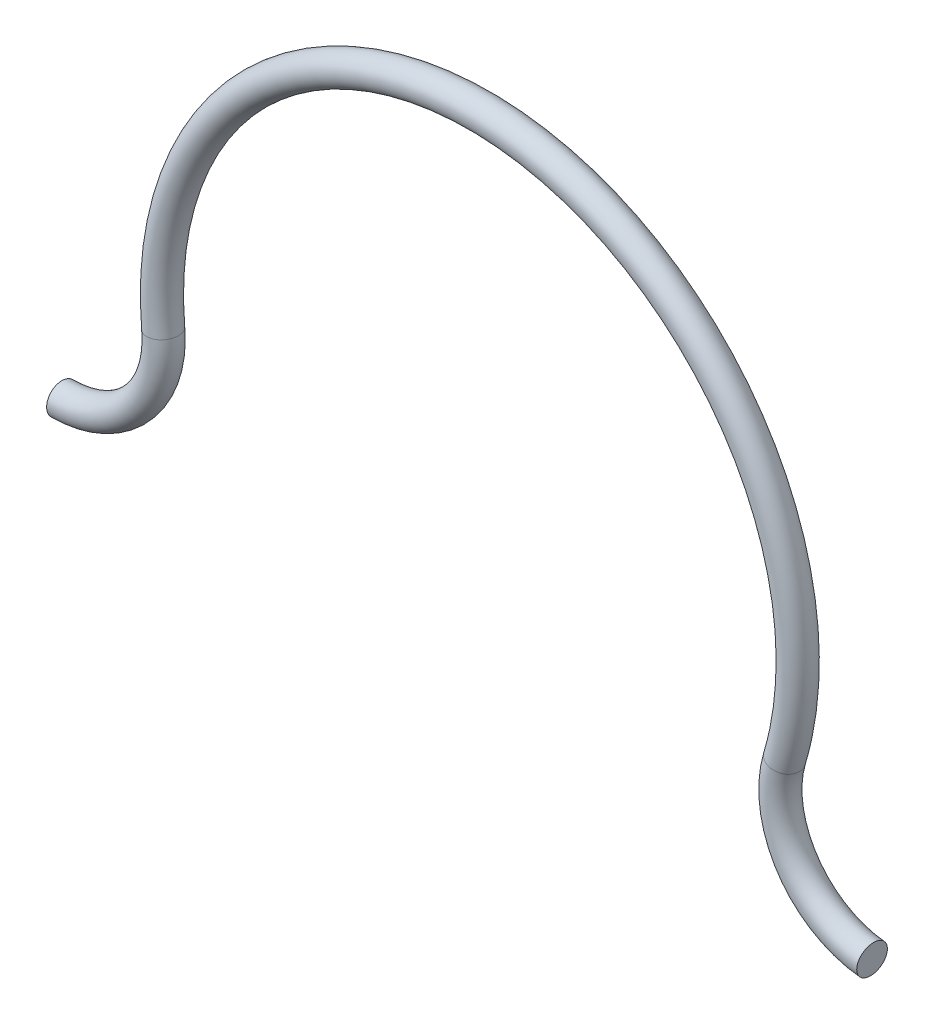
from build123d import *

# Parameters (mm, degrees)
SKIZZE3_R = 15


with BuildPart() as part:
    # Austragung1: sweep along a path in Skizze1
    with BuildLine(Plane.XY) as austragung1_path:
        ThreePointArc((0, -100), (73.864254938, -67.409731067), (99.583391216, 9.118563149))
        ThreePointArc((99.583391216, 9.118563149), (441.409407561, 348.453875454), (710.106013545, -51.290559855))
        ThreePointArc((710.106013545, -51.290559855), (722.960850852, -135.508779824), (796.064358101, -179.25615283))
    # Skizze3 → Austragung1 (sweep)
    with BuildSketch(Plane(origin=(0, 0, 0), x_dir=(0, 0, -1), z_dir=(1, 0, 0))):
        with Locations((0, -100)):
            Circle(SKIZZE3_R)
    sweep(path=austragung1_path.line)


solid = part.part
